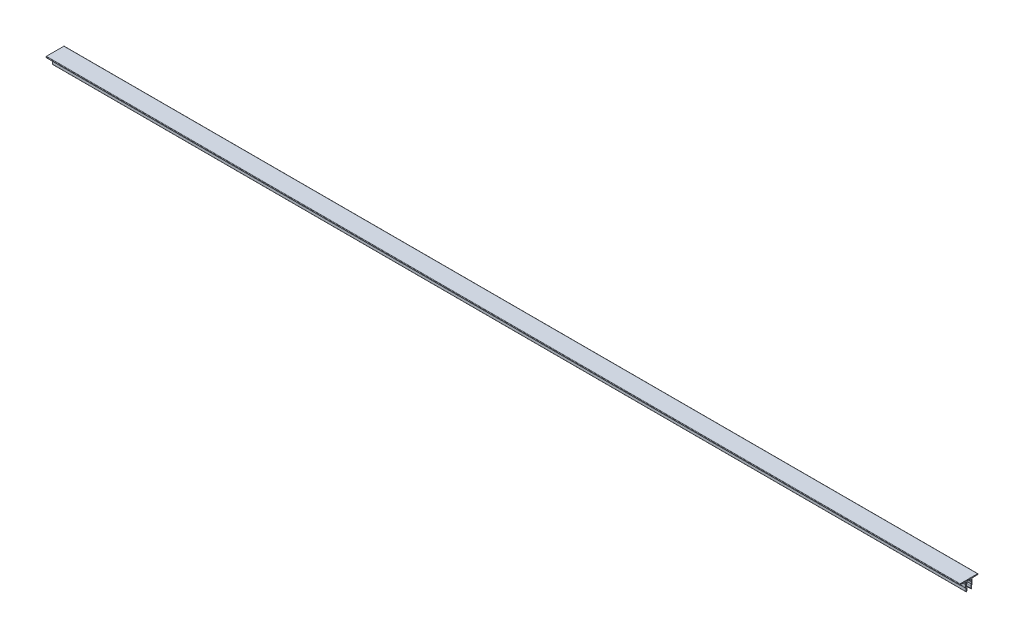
from build123d import *

# Parameters (mm, degrees)
EXTRUDE_1_DEPTH = 1000


with BuildPart() as part:
    # Sketch 2 → Extrude 1 (new body)
    with BuildSketch(Plane(origin=(0, 0, 0), x_dir=(0, 0, -1), z_dir=(1, 0, 0))):
        with BuildLine():
            Line((10, -1), (10, -0.5))
            ThreePointArc((10, -0.5), (9.853553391, -0.146446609), (9.5, 0))
            Line((9.5, 0), (-9.5, 0))
            ThreePointArc((-9.5, 0), (-9.853553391, -0.146446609), (-10, -0.5))
            Line((-10, -0.5), (-10, -1))
            Line((-10, -1), (-4, -1))
            ThreePointArc((-4, -1), (-3.434314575, -1.234314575), (-3.2, -1.8))
            Line((-3.2, -1.8), (-3.2, -2.7))
            ThreePointArc((-3.2, -2.7), (-3.281026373, -3.050823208), (-3.507692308, -3.330581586))
            ThreePointArc((-3.507692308, -3.330581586), (-3.649358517, -3.505430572), (-3.7, -3.724695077))
            Line((-3.7, -3.724695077), (-3.7, -6.647249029))
            ThreePointArc((-3.7, -6.647249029), (-3.633012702, -6.897249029), (-3.45, -7.080261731))
            ThreePointArc((-3.45, -7.080261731), (-3.193782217, -7.336479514), (-3.1, -7.686479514))
            Line((-3.1, -7.686479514), (-3.1, -10.7))
            ThreePointArc((-3.1, -10.7), (-3.012132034, -10.912132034), (-2.8, -11))
            Line((-2.8, -11), (-2.6, -11))
            Line((-2.6, -11), (-2.1, -10.133974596))
            Line((-2.1, -10.133974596), (-2.1, -7.686479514))
            ThreePointArc((-2.1, -7.686479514), (-2.220155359, -7.05871291), (-2.563636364, -6.519686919))
            ThreePointArc((-2.563636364, -6.519686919), (-2.664660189, -6.361149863), (-2.7, -6.176512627))
            Line((-2.7, -6.176512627), (-2.7, -4.290211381))
            ThreePointArc((-2.7, -4.290211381), (-2.633012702, -4.040211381), (-2.45, -3.857198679))
            ThreePointArc((-2.45, -3.857198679), (-2.266987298, -3.674185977), (-2.2, -3.424185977))
            Line((-2.2, -3.424185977), (-2.2, -1.5))
            ThreePointArc((-2.2, -1.5), (-2.053553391, -1.146446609), (-1.7, -1))
            Line((-1.7, -1), (1.7, -1))
            ThreePointArc((1.7, -1), (2.053553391, -1.146446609), (2.2, -1.5))
            Line((2.2, -1.5), (2.2, -3.424185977))
            ThreePointArc((2.2, -3.424185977), (2.266987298, -3.674185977), (2.45, -3.857198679))
            ThreePointArc((2.45, -3.857198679), (2.633012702, -4.040211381), (2.7, -4.290211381))
            Line((2.7, -4.290211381), (2.7, -6.176512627))
            ThreePointArc((2.7, -6.176512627), (2.664660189, -6.361149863), (2.563636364, -6.519686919))
            ThreePointArc((2.563636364, -6.519686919), (2.220155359, -7.05871291), (2.1, -7.686479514))
            Line((2.1, -7.686479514), (2.1, -10.133974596))
            Line((2.1, -10.133974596), (2.6, -11))
            Line((2.6, -11), (2.8, -11))
            ThreePointArc((2.8, -11), (3.012132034, -10.912132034), (3.1, -10.7))
            Line((3.1, -10.7), (3.1, -7.686479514))
            ThreePointArc((3.1, -7.686479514), (3.193782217, -7.336479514), (3.45, -7.080261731))
            ThreePointArc((3.45, -7.080261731), (3.633012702, -6.897249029), (3.7, -6.647249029))
            Line((3.7, -6.647249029), (3.7, -3.724695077))
            ThreePointArc((3.7, -3.724695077), (3.649358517, -3.505430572), (3.507692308, -3.330581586))
            ThreePointArc((3.507692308, -3.330581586), (3.281026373, -3.050823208), (3.2, -2.7))
            Line((3.2, -2.7), (3.2, -1.8))
            ThreePointArc((3.2, -1.8), (3.434314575, -1.234314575), (4, -1))
            Line((4, -1), (10, -1))
        make_face()
    extrude(amount=EXTRUDE_1_DEPTH)


solid = part.part
